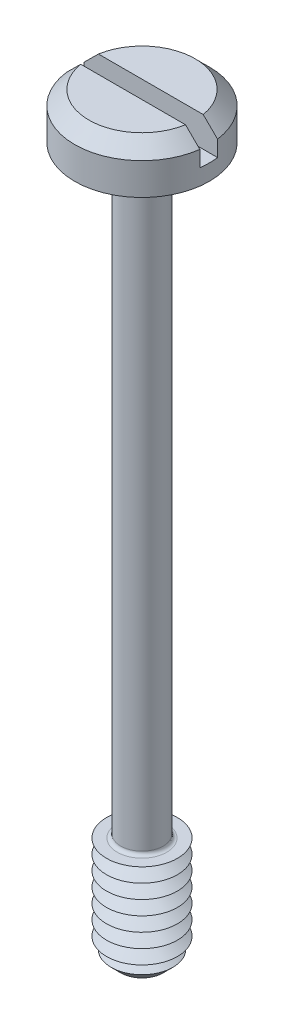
from build123d import *

# Parameters (mm, degrees)
SKETCH1_R           = 1.9
BOSS_EXTRUDE1_DEPTH = 1.3
SKETCH2_R           = 0.6
BOSS_EXTRUDE2_DEPTH = 20
SKETCH3_R           = 1
BOSS_EXTRUDE3_DEPTH = 3
CHAMFER1_SIZE       = 0.4
LPATTERN1_COUNT     = 7
LPATTERN1_PITCH     = 0.4
FILLET1_R           = 0.1
CHAMFER2_SIZE       = 0.4
SKETCH6_W           = 3.8
SKETCH6_H           = 0.5
CUT_EXTRUDE1_DEPTH  = 0.85


with BuildPart() as part:
    # Sketch1 → Boss-Extrude1 (new body)
    with BuildSketch(Plane(origin=(0, 0, 0), x_dir=(1, 0, 0), z_dir=(0, 1, 0))):
        with Locations(Location((0, 0, 0), (0, 0, 270))):
            Circle(SKETCH1_R)
    extrude(amount=BOSS_EXTRUDE1_DEPTH)

    # Sketch2 → Boss-Extrude2 (add)
    with BuildSketch(Plane.XZ):
        with Locations(Location((0, 0, 0), (0, 0, 270))):
            Circle(SKETCH2_R)
    extrude(amount=BOSS_EXTRUDE2_DEPTH)

    # Sketch3 → Boss-Extrude3 (add)
    with BuildSketch(Plane.XZ.offset(20)):
        with Locations(Location((0, 0, 0), (0, 0, 270))):
            Circle(SKETCH3_R)
    extrude(amount=-BOSS_EXTRUDE3_DEPTH)

    # Chamfer1
    chamfer1_edges = [part.edges().sort_by_distance(p)[0] for p in [
        (0, -20, 1),
    ]]
    chamfer(chamfer1_edges, length=CHAMFER1_SIZE)

    # Sketch5 → Cut-Revolve1 (revolve, cut)
    with BuildSketch(Plane(origin=(0, 0, 0), x_dir=(0, 0, -1), z_dir=(1, 0, 0))):
        Polygon((-1, -17), (-0.653589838, -17.2), (-1, -17.4), align=None)
    cut_revolve1 = revolve(axis=Axis((0, -6.58711856, 0), (0, -1, 0)), mode=Mode.SUBTRACT)

    # LPattern1: Cut-Revolve1 ×7
    with Locations(*[(0, -i * LPATTERN1_PITCH, 0) for i in range(1, LPATTERN1_COUNT)]):
        add(cut_revolve1, mode=Mode.SUBTRACT)

    # Fillet1
    fillet1_edges = [part.edges().sort_by_distance(p)[0] for p in [
        (0, 0, 0.6),
        (0, -17, 0.6),
    ]]
    fillet(fillet1_edges, radius=FILLET1_R)

    # Chamfer2
    chamfer2_edges = [part.edges().sort_by_distance(p)[0] for p in [
        (0, 1.3, -1.9),
    ]]
    chamfer(chamfer2_edges, length=CHAMFER2_SIZE)

    # Sketch6 → Cut-Extrude1 (cut)
    with BuildSketch(Plane(origin=(0, 1.3, 0), x_dir=(1, 0, 0), z_dir=(0, 1, 0))):
        Rectangle(SKETCH6_W, SKETCH6_H)
    extrude(amount=-CUT_EXTRUDE1_DEPTH, mode=Mode.SUBTRACT)


solid = part.part
